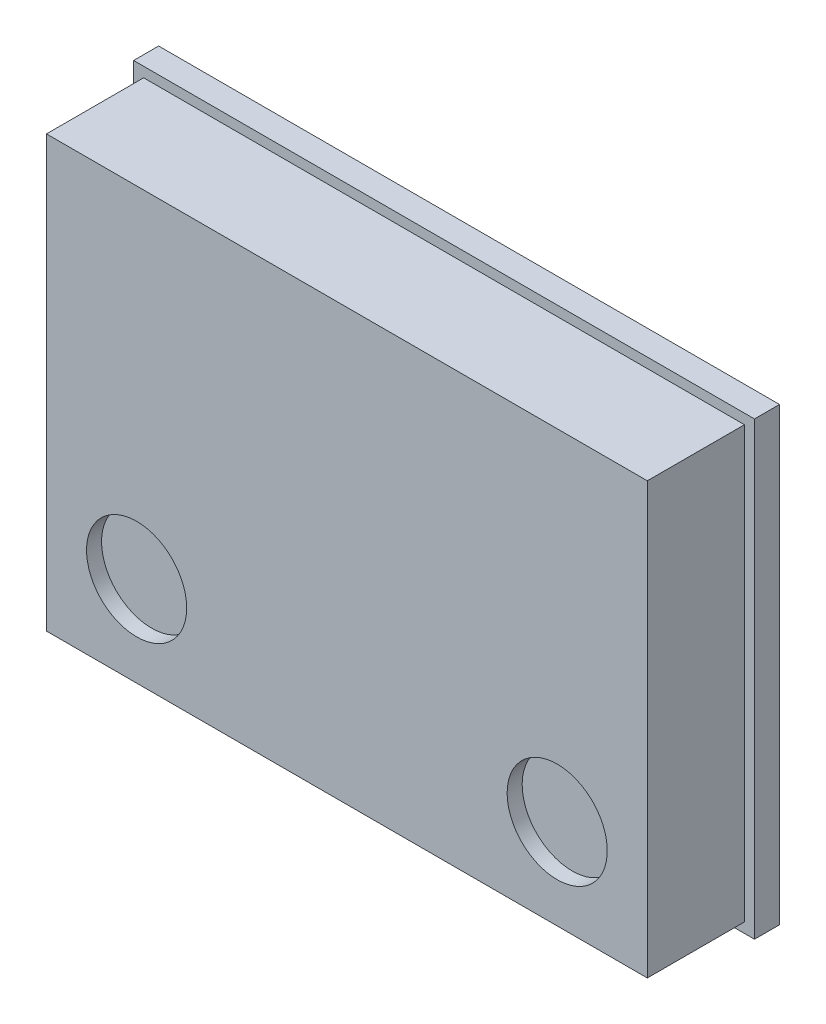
from build123d import *

# Parameters (mm, degrees)
LINEAR_AUSTRAGEN1_DEPTH      = 0.125
LINEAR_AUSTRAGEN1_DEPTH_BACK = 0.125
SKIZZE1_W                    = 3.1
SKIZZE1_H                    = 4.5
SKIZZE3_W                    = 3
SKIZZE3_H                    = 4.3
LINEAR_AUSTRAGEN3_DEPTH      = 0.97
SKIZZE4_R                    = 0.5
LINEAR_AUSTRAGEN4_DEPTH      = 0.15


with BuildPart() as part:
    # Skizze1 → Linear austragen1 (new, two sides: drawn at the far end of the back side and taken through both)
    with BuildSketch(Plane.XY.offset(-LINEAR_AUSTRAGEN1_DEPTH_BACK)):
        with Locations((-1.55, -0.75)):
            Rectangle(SKIZZE1_W, SKIZZE1_H)
    extrude(amount=LINEAR_AUSTRAGEN1_DEPTH + LINEAR_AUSTRAGEN1_DEPTH_BACK)

    # Spiegeln1: part across plane


with BuildPart() as body_2:
    # Skizze3 → Linear austragen3 (new body)
    with BuildSketch(Plane.XY.offset(0.125)):
        with Locations((-1.5, -0.75)):
            Rectangle(SKIZZE3_W, SKIZZE3_H)
    extrude(amount=LINEAR_AUSTRAGEN3_DEPTH)

    # Skizze4 → Linear austragen4 (cut)
    with BuildSketch(Plane.XY.offset(1.095)):
        with Locations((-2.1, -2)):
            Circle(SKIZZE4_R)
    extrude(amount=-LINEAR_AUSTRAGEN4_DEPTH, mode=Mode.SUBTRACT)

    # Spiegeln1 2: body 2 across plane


with BuildPart() as part_1:
    add(part.part)
    add(part.part.mirror(Plane(origin=(0, 0, 0), x_dir=(0, 0, 1), z_dir=(1, 0, 0))))


with BuildPart() as body_2_1:
    add(body_2.part)
    add(body_2.part.mirror(Plane(origin=(0, 0, 0), x_dir=(0, 0, 1), z_dir=(1, 0, 0))))


solid = Compound([part_1.part, body_2_1.part])
